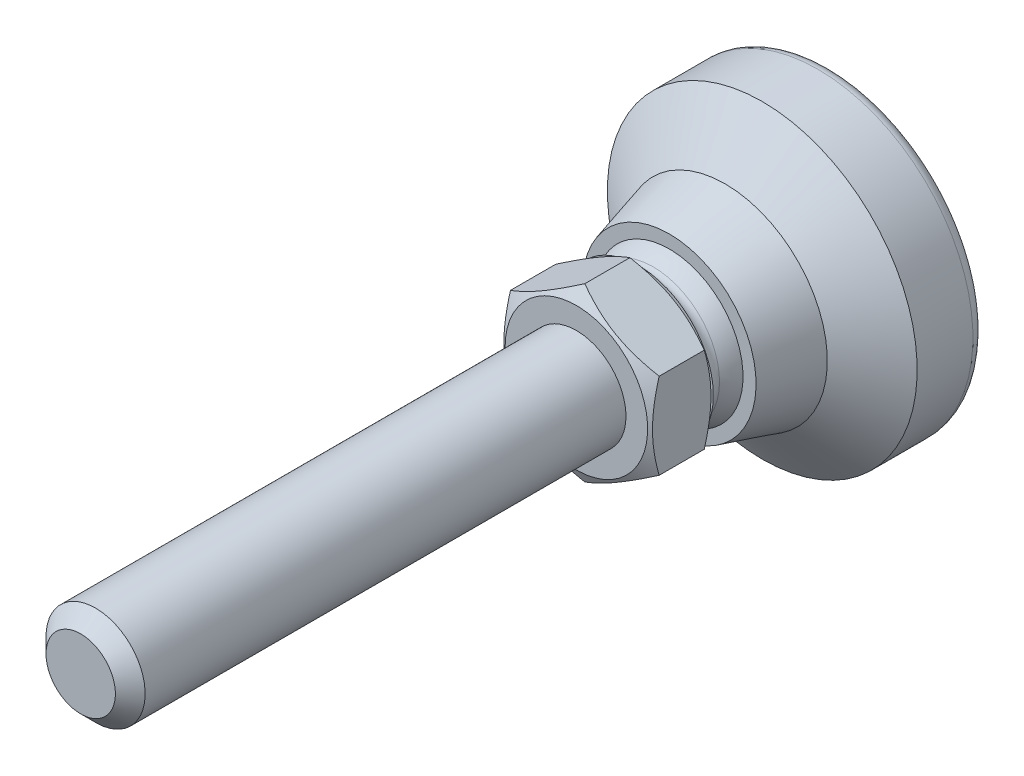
ISO-10303-21;
HEADER;
FILE_DESCRIPTION(('STEP AP214'),'2;1');
FILE_NAME('part.step','',(''),(''),'','','');
FILE_SCHEMA(('AUTOMOTIVE_DESIGN { 1 0 10303 214 1 1 1 1 }'));
ENDSEC;
DATA;
#1=APPLICATION_CONTEXT('core data for automotive mechanical design processes');
#2=APPLICATION_PROTOCOL_DEFINITION('international standard','automotive_design',2000,#1);
#3=PRODUCT_CONTEXT('',#1,'mechanical');
#4=PRODUCT('Part','Part','',(#3));
#5=PRODUCT_RELATED_PRODUCT_CATEGORY('part','',(#4));
#6=PRODUCT_DEFINITION_FORMATION('','',#4);
#7=PRODUCT_DEFINITION_CONTEXT('part definition',#1,'design');
#8=PRODUCT_DEFINITION('design','',#6,#7);
#9=PRODUCT_DEFINITION_SHAPE('','',#8);
#10=(LENGTH_UNIT() NAMED_UNIT(*) SI_UNIT(.MILLI.,.METRE.));
#11=(NAMED_UNIT(*) PLANE_ANGLE_UNIT() SI_UNIT($,.RADIAN.));
#12=(NAMED_UNIT(*) SI_UNIT($,.STERADIAN.) SOLID_ANGLE_UNIT());
#13=UNCERTAINTY_MEASURE_WITH_UNIT(LENGTH_MEASURE(1.E-05),#10,'distance_accuracy_value','');
#14=(GEOMETRIC_REPRESENTATION_CONTEXT(3) GLOBAL_UNCERTAINTY_ASSIGNED_CONTEXT((#13)) GLOBAL_UNIT_ASSIGNED_CONTEXT((#10,
#11,#12)) REPRESENTATION_CONTEXT('',''));
#15=CARTESIAN_POINT('',(0.,0.,0.));
#16=DIRECTION('',(0.,0.,1.));
#17=DIRECTION('',(1.,0.,0.));
#18=AXIS2_PLACEMENT_3D('',#15,#16,#17);
#19=CARTESIAN_POINT('',(0.,0.,14.6997728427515));
#20=DIRECTION('',(0.,0.,-1.));
#21=DIRECTION('',(0.,1.,0.));
#22=AXIS2_PLACEMENT_3D('',#19,#20,#21);
#23=TOROIDAL_SURFACE('',#22,6.05010572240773,0.800227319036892);
#24=CARTESIAN_POINT('',(0.,0.,14.3053528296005));
#25=DIRECTION('',(0.,0.,-1.));
#26=DIRECTION('',(0.,1.,0.));
#27=AXIS2_PLACEMENT_3D('',#24,#25,#26);
#28=CIRCLE('',#27,5.35383234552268);
#29=CARTESIAN_POINT('',(-5.3538323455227,0.,14.3053528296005));
#30=VERTEX_POINT('',#29);
#31=EDGE_CURVE('E163',#30,#30,#28,.T.);
#32=ORIENTED_EDGE('',*,*,#31,.F.);
#33=EDGE_LOOP('',(#32));
#34=FACE_BOUND('',#33,.T.);
#35=CARTESIAN_POINT('',(2.32740595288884,5.58441436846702,15.5000001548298));
#36=CARTESIAN_POINT('',(2.38730882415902,5.55944918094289,15.5000001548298));
#37=CARTESIAN_POINT('',(2.44680968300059,5.53351945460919,15.5000001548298));
#38=CARTESIAN_POINT('',(2.56494646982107,5.47975932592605,15.5000001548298));
#39=CARTESIAN_POINT('',(2.62358239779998,5.45192892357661,15.5000001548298));
#40=CARTESIAN_POINT('',(2.73992841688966,5.39439584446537,15.5000001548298));
#41=CARTESIAN_POINT('',(2.79763850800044,5.36469316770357,15.5000001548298));
#42=CARTESIAN_POINT('',(2.91207314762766,5.30344640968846,15.5000001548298));
#43=CARTESIAN_POINT('',(2.96879769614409,5.27190232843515,15.5000001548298));
#44=CARTESIAN_POINT('',(3.08120249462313,5.20700538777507,15.5000001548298));
#45=CARTESIAN_POINT('',(3.13688274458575,5.17365252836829,15.5000001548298));
#46=CARTESIAN_POINT('',(3.24714131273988,5.10517260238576,15.5000001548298));
#47=CARTESIAN_POINT('',(3.30171963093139,5.07004553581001,15.5000001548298));
#48=CARTESIAN_POINT('',(3.40971774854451,4.99805346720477,15.5000001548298));
#49=CARTESIAN_POINT('',(3.46313754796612,4.96118846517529,15.5000001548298));
#50=CARTESIAN_POINT('',(3.56876357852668,4.88575907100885,15.5000001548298));
#51=CARTESIAN_POINT('',(3.62096980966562,4.84719467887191,15.5000001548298));
#52=CARTESIAN_POINT('',(3.67254173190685,4.80779986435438,15.5000001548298));
#53=B_SPLINE_CURVE_WITH_KNOTS('',3,(#35,#36,#37,#38,#39,#40,#41,#42,#43,#44,#45,#46,#47,#48,#49,
#50,#51,#52),.UNSPECIFIED.,.F.,.F.,(4,2,2,2,2,2,2,2,4),(0.,0.194682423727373,0.389364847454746,
0.584047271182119,0.778729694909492,0.973412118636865,1.16809454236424,1.36277696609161,
1.55745938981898),.UNSPECIFIED.);
#54=CARTESIAN_POINT('',(2.32724464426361,5.58455280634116,15.5000001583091));
#55=VERTEX_POINT('',#54);
#56=CARTESIAN_POINT('',(3.67274227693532,4.80772938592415,15.5000001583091));
#57=VERTEX_POINT('',#56);
#58=EDGE_CURVE('E109',#55,#57,#53,.T.);
#59=ORIENTED_EDGE('',*,*,#58,.T.);
#60=CARTESIAN_POINT('',(0.,0.,15.5000001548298));
#61=DIRECTION('',(0.,0.,-1.));
#62=DIRECTION('',(0.,1.,0.));
#63=AXIS2_PLACEMENT_3D('',#60,#61,#62);
#64=CIRCLE('',#63,6.05000019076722);
#65=CARTESIAN_POINT('',(5.99998692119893,0.77682342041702,15.5000001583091));
#66=VERTEX_POINT('',#65);
#67=EDGE_CURVE('E169',#57,#66,#64,.T.);
#68=ORIENTED_EDGE('',*,*,#67,.T.);
#69=CARTESIAN_POINT('',(5.9999476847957,0.776614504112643,15.5000001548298));
#70=CARTESIAN_POINT('',(6.00827863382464,0.712254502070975,15.5000001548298));
#71=CARTESIAN_POINT('',(6.01557326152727,0.647760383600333,15.5000001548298));
#72=CARTESIAN_POINT('',(6.02808401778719,0.518570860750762,15.5000001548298));
#73=CARTESIAN_POINT('',(6.03330014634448,0.453875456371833,15.5000001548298));
#74=CARTESIAN_POINT('',(6.04164804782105,0.324350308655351,15.5000001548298));
#75=CARTESIAN_POINT('',(6.04477982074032,0.259520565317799,15.5000001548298));
#76=CARTESIAN_POINT('',(6.04895589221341,0.129793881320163,15.5000001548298));
#77=CARTESIAN_POINT('',(6.05000019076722,0.064896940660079,15.5000001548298));
#78=CARTESIAN_POINT('',(6.05000019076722,-0.0648969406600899,15.5000001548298));
#79=CARTESIAN_POINT('',(6.04895589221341,-0.129793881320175,15.5000001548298));
#80=CARTESIAN_POINT('',(6.04477982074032,-0.259520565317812,15.5000001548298));
#81=CARTESIAN_POINT('',(6.04164804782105,-0.324350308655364,15.5000001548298));
#82=CARTESIAN_POINT('',(6.03330014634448,-0.453875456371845,15.5000001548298));
#83=CARTESIAN_POINT('',(6.02808401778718,-0.518570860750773,15.5000001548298));
#84=CARTESIAN_POINT('',(6.01557326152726,-0.647760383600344,15.5000001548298));
#85=CARTESIAN_POINT('',(6.00827863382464,-0.712254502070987,15.5000001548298));
#86=CARTESIAN_POINT('',(5.9999476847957,-0.776614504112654,15.5000001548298));
#87=B_SPLINE_CURVE_WITH_KNOTS('',3,(#69,#70,#71,#72,#73,#74,#75,#76,#77,#78,#79,#80,#81,#82,#83,
#84,#85,#86),.UNSPECIFIED.,.F.,.F.,(4,2,2,2,2,2,2,2,4),(0.,0.194682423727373,0.389364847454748,
0.584047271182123,0.778729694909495,0.973412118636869,1.16809454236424,1.36277696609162,
1.55745938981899),.UNSPECIFIED.);
#88=CARTESIAN_POINT('',(5.99998692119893,-0.77682342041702,15.5000001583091));
#89=VERTEX_POINT('',#88);
#90=EDGE_CURVE('E615',#66,#89,#87,.T.);
#91=ORIENTED_EDGE('',*,*,#90,.T.);
#92=CARTESIAN_POINT('',(3.67274227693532,-4.80772938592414,15.5000001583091));
#93=VERTEX_POINT('',#92);
#94=EDGE_CURVE('E179',#89,#93,#64,.T.);
#95=ORIENTED_EDGE('',*,*,#94,.T.);
#96=CARTESIAN_POINT('',(3.67254173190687,-4.80779986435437,15.5000001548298));
#97=CARTESIAN_POINT('',(3.62096980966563,-4.8471946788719,15.5000001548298));
#98=CARTESIAN_POINT('',(3.56876357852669,-4.88575907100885,15.5000001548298));
#99=CARTESIAN_POINT('',(3.46313754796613,-4.96118846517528,15.5000001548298));
#100=CARTESIAN_POINT('',(3.40971774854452,-4.99805346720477,15.5000001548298));
#101=CARTESIAN_POINT('',(3.3017196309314,-5.07004553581,15.5000001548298));
#102=CARTESIAN_POINT('',(3.24714131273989,-5.10517260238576,15.5000001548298));
#103=CARTESIAN_POINT('',(3.13688274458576,-5.17365252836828,15.5000001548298));
#104=CARTESIAN_POINT('',(3.08120249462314,-5.20700538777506,15.5000001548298));
#105=CARTESIAN_POINT('',(2.9687976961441,-5.27190232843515,15.5000001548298));
#106=CARTESIAN_POINT('',(2.91207314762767,-5.30344640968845,15.5000001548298));
#107=CARTESIAN_POINT('',(2.79763850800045,-5.36469316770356,15.5000001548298));
#108=CARTESIAN_POINT('',(2.73992841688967,-5.39439584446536,15.5000001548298));
#109=CARTESIAN_POINT('',(2.62358239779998,-5.4519289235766,15.5000001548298));
#110=CARTESIAN_POINT('',(2.56494646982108,-5.47975932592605,15.5000001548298));
#111=CARTESIAN_POINT('',(2.4468096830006,-5.53351945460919,15.5000001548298));
#112=CARTESIAN_POINT('',(2.38730882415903,-5.55944918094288,15.5000001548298));
#113=CARTESIAN_POINT('',(2.32740595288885,-5.58441436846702,15.5000001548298));
#114=B_SPLINE_CURVE_WITH_KNOTS('',3,(#96,#97,#98,#99,#100,#101,#102,#103,#104,#105,#106,#107,
#108,#109,#110,#111,#112,#113),.UNSPECIFIED.,.F.,.F.,(4,2,2,2,2,2,2,2,4),(0.,0.194682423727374,
0.389364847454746,0.584047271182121,0.778729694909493,0.973412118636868,1.16809454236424,
1.36277696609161,1.55745938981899),.UNSPECIFIED.);
#115=CARTESIAN_POINT('',(2.32724464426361,-5.58455280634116,15.5000001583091));
#116=VERTEX_POINT('',#115);
#117=EDGE_CURVE('E262',#93,#116,#114,.T.);
#118=ORIENTED_EDGE('',*,*,#117,.T.);
#119=CARTESIAN_POINT('',(-2.32724464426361,-5.58455280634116,15.5000001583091));
#120=VERTEX_POINT('',#119);
#121=EDGE_CURVE('E181',#116,#120,#64,.T.);
#122=ORIENTED_EDGE('',*,*,#121,.T.);
#123=CARTESIAN_POINT('',(-2.32740595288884,-5.58441436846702,15.5000001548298));
#124=CARTESIAN_POINT('',(-2.38730882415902,-5.55944918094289,15.5000001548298));
#125=CARTESIAN_POINT('',(-2.44680968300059,-5.53351945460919,15.5000001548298));
#126=CARTESIAN_POINT('',(-2.56494646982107,-5.47975932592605,15.5000001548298));
#127=CARTESIAN_POINT('',(-2.62358239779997,-5.45192892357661,15.5000001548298));
#128=CARTESIAN_POINT('',(-2.73992841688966,-5.39439584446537,15.5000001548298));
#129=CARTESIAN_POINT('',(-2.79763850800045,-5.36469316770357,15.5000001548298));
#130=CARTESIAN_POINT('',(-2.91207314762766,-5.30344640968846,15.5000001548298));
#131=CARTESIAN_POINT('',(-2.96879769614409,-5.27190232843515,15.5000001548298));
#132=CARTESIAN_POINT('',(-3.08120249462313,-5.20700538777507,15.5000001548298));
#133=CARTESIAN_POINT('',(-3.13688274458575,-5.17365252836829,15.5000001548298));
#134=CARTESIAN_POINT('',(-3.24714131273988,-5.10517260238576,15.5000001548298));
#135=CARTESIAN_POINT('',(-3.30171963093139,-5.07004553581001,15.5000001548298));
#136=CARTESIAN_POINT('',(-3.40971774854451,-4.99805346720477,15.5000001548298));
#137=CARTESIAN_POINT('',(-3.46313754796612,-4.96118846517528,15.5000001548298));
#138=CARTESIAN_POINT('',(-3.56876357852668,-4.88575907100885,15.5000001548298));
#139=CARTESIAN_POINT('',(-3.62096980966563,-4.84719467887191,15.5000001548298));
#140=CARTESIAN_POINT('',(-3.67254173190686,-4.80779986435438,15.5000001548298));
#141=B_SPLINE_CURVE_WITH_KNOTS('',3,(#123,#124,#125,#126,#127,#128,#129,#130,#131,#132,#133,
#134,#135,#136,#137,#138,#139,#140),.UNSPECIFIED.,.F.,.F.,(4,2,2,2,2,2,2,2,4),(0.,
0.194682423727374,0.389364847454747,0.584047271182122,0.778729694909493,0.973412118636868,
1.16809454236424,1.36277696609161,1.55745938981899),.UNSPECIFIED.);
#142=CARTESIAN_POINT('',(-3.67274227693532,-4.80772938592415,15.5000001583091));
#143=VERTEX_POINT('',#142);
#144=EDGE_CURVE('E148',#120,#143,#141,.T.);
#145=ORIENTED_EDGE('',*,*,#144,.T.);
#146=CARTESIAN_POINT('',(-5.99999019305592,-0.776824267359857,15.5000001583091));
#147=VERTEX_POINT('',#146);
#148=EDGE_CURVE('E183',#143,#147,#64,.T.);
#149=ORIENTED_EDGE('',*,*,#148,.T.);
#150=CARTESIAN_POINT('',(-5.9999476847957,-0.776614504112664,15.5000001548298));
#151=CARTESIAN_POINT('',(-6.00827863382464,-0.712254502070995,15.5000001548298));
#152=CARTESIAN_POINT('',(-6.01557326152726,-0.647760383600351,15.5000001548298));
#153=CARTESIAN_POINT('',(-6.02808401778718,-0.518570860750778,15.5000001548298));
#154=CARTESIAN_POINT('',(-6.03330014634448,-0.453875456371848,15.5000001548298));
#155=CARTESIAN_POINT('',(-6.04164804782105,-0.324350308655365,15.5000001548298));
#156=CARTESIAN_POINT('',(-6.04477982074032,-0.259520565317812,15.5000001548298));
#157=CARTESIAN_POINT('',(-6.04895589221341,-0.129793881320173,15.5000001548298));
#158=CARTESIAN_POINT('',(-6.05000019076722,-0.0648969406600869,15.5000001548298));
#159=CARTESIAN_POINT('',(-6.05000019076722,0.0648969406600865,15.5000001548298));
#160=CARTESIAN_POINT('',(-6.04895589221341,0.129793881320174,15.5000001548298));
#161=CARTESIAN_POINT('',(-6.04477982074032,0.259520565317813,15.5000001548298));
#162=CARTESIAN_POINT('',(-6.04164804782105,0.324350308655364,15.5000001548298));
#163=CARTESIAN_POINT('',(-6.03330014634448,0.453875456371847,15.5000001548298));
#164=CARTESIAN_POINT('',(-6.02808401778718,0.518570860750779,15.5000001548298));
#165=CARTESIAN_POINT('',(-6.01557326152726,0.647760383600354,15.5000001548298));
#166=CARTESIAN_POINT('',(-6.00827863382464,0.712254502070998,15.5000001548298));
#167=CARTESIAN_POINT('',(-5.99994768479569,0.776614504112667,15.5000001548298));
#168=B_SPLINE_CURVE_WITH_KNOTS('',3,(#150,#151,#152,#153,#154,#155,#156,#157,#158,#159,#160,
#161,#162,#163,#164,#165,#166,#167),.UNSPECIFIED.,.F.,.F.,(4,2,2,2,2,2,2,2,4),(0.,
0.194682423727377,0.389364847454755,0.584047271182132,0.778729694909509,0.973412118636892,
1.16809454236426,1.36277696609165,1.55745938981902),.UNSPECIFIED.);
#169=CARTESIAN_POINT('',(-5.99998692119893,0.776823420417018,15.5000001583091));
#170=VERTEX_POINT('',#169);
#171=EDGE_CURVE('E121',#147,#170,#168,.T.);
#172=ORIENTED_EDGE('',*,*,#171,.T.);
#173=CARTESIAN_POINT('',(-3.67274464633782,4.80773179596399,15.5000001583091));
#174=VERTEX_POINT('',#173);
#175=EDGE_CURVE('E185',#170,#174,#64,.T.);
#176=ORIENTED_EDGE('',*,*,#175,.T.);
#177=CARTESIAN_POINT('',(-3.67254173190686,4.80779986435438,15.5000001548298));
#178=CARTESIAN_POINT('',(-3.62096980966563,4.84719467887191,15.5000001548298));
#179=CARTESIAN_POINT('',(-3.56876357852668,4.88575907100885,15.5000001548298));
#180=CARTESIAN_POINT('',(-3.46313754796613,4.96118846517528,15.5000001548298));
#181=CARTESIAN_POINT('',(-3.40971774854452,4.99805346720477,15.5000001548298));
#182=CARTESIAN_POINT('',(-3.3017196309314,5.07004553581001,15.5000001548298));
#183=CARTESIAN_POINT('',(-3.24714131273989,5.10517260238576,15.5000001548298));
#184=CARTESIAN_POINT('',(-3.13688274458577,5.17365252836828,15.5000001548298));
#185=CARTESIAN_POINT('',(-3.08120249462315,5.20700538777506,15.5000001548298));
#186=CARTESIAN_POINT('',(-2.9687976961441,5.27190232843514,15.5000001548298));
#187=CARTESIAN_POINT('',(-2.91207314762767,5.30344640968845,15.5000001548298));
#188=CARTESIAN_POINT('',(-2.79763850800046,5.36469316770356,15.5000001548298));
#189=CARTESIAN_POINT('',(-2.73992841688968,5.39439584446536,15.5000001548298));
#190=CARTESIAN_POINT('',(-2.62358239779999,5.4519289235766,15.5000001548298));
#191=CARTESIAN_POINT('',(-2.56494646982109,5.47975932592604,15.5000001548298));
#192=CARTESIAN_POINT('',(-2.44680968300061,5.53351945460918,15.5000001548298));
#193=CARTESIAN_POINT('',(-2.38730882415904,5.55944918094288,15.5000001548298));
#194=CARTESIAN_POINT('',(-2.32740595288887,5.58441436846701,15.5000001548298));
#195=B_SPLINE_CURVE_WITH_KNOTS('',3,(#177,#178,#179,#180,#181,#182,#183,#184,#185,#186,#187,
#188,#189,#190,#191,#192,#193,#194),.UNSPECIFIED.,.F.,.F.,(4,2,2,2,2,2,2,2,4),(0.,
0.194682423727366,0.389364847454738,0.58404727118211,0.778729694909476,0.973412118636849,
1.16809454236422,1.36277696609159,1.55745938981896),.UNSPECIFIED.);
#196=CARTESIAN_POINT('',(-2.32724464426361,5.58455280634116,15.5000001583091));
#197=VERTEX_POINT('',#196);
#198=EDGE_CURVE('E124',#174,#197,#195,.T.);
#199=ORIENTED_EDGE('',*,*,#198,.T.);
#200=EDGE_CURVE('E166',#197,#55,#64,.T.);
#201=ORIENTED_EDGE('',*,*,#200,.T.);
#202=EDGE_LOOP('',(#59,#68,#91,#95,#118,#122,#145,#149,#172,#176,#199,#201));
#203=FACE_BOUND('',#202,.T.);
#204=ADVANCED_FACE('F14',(#34,#203),#23,.F.);
#205=CARTESIAN_POINT('',(0.,0.,11.080608));
#206=DIRECTION('',(0.,0.,-1.));
#207=DIRECTION('',(-1.,0.,0.));
#208=AXIS2_PLACEMENT_3D('',#205,#206,#207);
#209=SPHERICAL_SURFACE('',#208,6.25);
#210=CARTESIAN_POINT('',(0.,0.,13.0000001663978));
#211=DIRECTION('',(0.,0.,-1.));
#212=DIRECTION('',(0.,1.,0.));
#213=AXIS2_PLACEMENT_3D('',#210,#211,#212);
#214=CIRCLE('',#213,5.94797727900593);
#215=CARTESIAN_POINT('',(-5.94797727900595,0.,13.0000001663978));
#216=VERTEX_POINT('',#215);
#217=EDGE_CURVE('E160',#216,#216,#214,.T.);
#218=CARTESIAN_POINT('',(-5.94797727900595,0.,13.0000001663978));
#219=CARTESIAN_POINT('',(-5.94337913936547,0.,13.0142492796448));
#220=CARTESIAN_POINT('',(-5.9387297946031,0.,13.028481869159));
#221=CARTESIAN_POINT('',(-5.92932893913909,0.,13.0569132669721));
#222=CARTESIAN_POINT('',(-5.92457742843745,0.,13.0711120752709));
#223=CARTESIAN_POINT('',(-5.91497248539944,0.,13.0994751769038));
#224=CARTESIAN_POINT('',(-5.91011905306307,0.,13.1136394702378));
#225=CARTESIAN_POINT('',(-5.90031051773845,0.,13.1419328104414));
#226=CARTESIAN_POINT('',(-5.8953554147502,0.,13.1560618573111));
#227=CARTESIAN_POINT('',(-5.88534379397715,0.,13.1842839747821));
#228=CARTESIAN_POINT('',(-5.88028727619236,0.,13.1983770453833));
#229=CARTESIAN_POINT('',(-5.87007308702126,0.,13.2265264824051));
#230=CARTESIAN_POINT('',(-5.86491541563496,0.,13.2405828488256));
#231=CARTESIAN_POINT('',(-5.85449918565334,0.,13.2686581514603));
#232=CARTESIAN_POINT('',(-5.84924062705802,0.,13.2826770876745));
#233=CARTESIAN_POINT('',(-5.83862289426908,0.,13.3106768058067));
#234=CARTESIAN_POINT('',(-5.83326372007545,0.,13.3246575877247));
#235=CARTESIAN_POINT('',(-5.82244503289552,0.,13.3525802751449));
#236=CARTESIAN_POINT('',(-5.81698551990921,0.,13.366522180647));
#237=CARTESIAN_POINT('',(-5.80596643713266,0.,13.3943663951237));
#238=CARTESIAN_POINT('',(-5.80040686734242,0.,13.4082687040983));
#239=CARTESIAN_POINT('',(-5.78918795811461,0.,13.4360330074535));
#240=CARTESIAN_POINT('',(-5.78352861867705,0.,13.4498950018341));
#241=CARTESIAN_POINT('',(-5.77211046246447,0.,13.4775779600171));
#242=CARTESIAN_POINT('',(-5.76635164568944,0.,13.4913989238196));
#243=CARTESIAN_POINT('',(-5.75473483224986,0.,13.5189991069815));
#244=CARTESIAN_POINT('',(-5.7488768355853,0.,13.532778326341));
#245=CARTESIAN_POINT('',(-5.73706196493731,0.,13.560294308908));
#246=CARTESIAN_POINT('',(-5.73110509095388,0.,13.5740310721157));
#247=CARTESIAN_POINT('',(-5.71909277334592,0.,13.6014614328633));
#248=CARTESIAN_POINT('',(-5.71303732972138,0.,13.6151550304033));
#249=CARTESIAN_POINT('',(-5.70082818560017,0.,13.6424983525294));
#250=CARTESIAN_POINT('',(-5.69467448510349,0.,13.6561480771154));
#251=CARTESIAN_POINT('',(-5.68226914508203,0.,13.6834029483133));
#252=CARTESIAN_POINT('',(-5.67601750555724,0.,13.6970080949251));
#253=CARTESIAN_POINT('',(-5.66341661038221,0.,13.7241731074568));
#254=CARTESIAN_POINT('',(-5.65706735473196,0.,13.7377329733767));
#255=CARTESIAN_POINT('',(-5.64427155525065,0.,13.7648067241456));
#256=CARTESIAN_POINT('',(-5.63782501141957,0.,13.7783206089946));
#257=CARTESIAN_POINT('',(-5.62483496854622,0.,13.8053016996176));
#258=CARTESIAN_POINT('',(-5.61829146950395,0.,13.8187689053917));
#259=CARTESIAN_POINT('',(-5.60510785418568,0.,13.845655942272));
#260=CARTESIAN_POINT('',(-5.59846773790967,0.,13.8590757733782));
#261=CARTESIAN_POINT('',(-5.58509123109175,0.,13.8858673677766));
#262=CARTESIAN_POINT('',(-5.57835484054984,0.,13.8992391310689));
#263=CARTESIAN_POINT('',(-5.56478613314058,0.,13.9259338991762));
#264=CARTESIAN_POINT('',(-5.55795381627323,0.,13.9392569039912));
#265=CARTESIAN_POINT('',(-5.54419360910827,0.,13.9658534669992));
#266=CARTESIAN_POINT('',(-5.53726571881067,0.,13.9791270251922));
#267=CARTESIAN_POINT('',(-5.5233147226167,0.,14.005624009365));
#268=CARTESIAN_POINT('',(-5.51629161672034,0.,14.0188474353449));
#269=CARTESIAN_POINT('',(-5.50215055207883,0.,14.0452434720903));
#270=CARTESIAN_POINT('',(-5.49503259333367,0.,14.0584160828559));
#271=CARTESIAN_POINT('',(-5.48070219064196,0.,14.0847098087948));
#272=CARTESIAN_POINT('',(-5.4734897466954,0.,14.0978309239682));
#273=CARTESIAN_POINT('',(-5.45897074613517,0.,14.124020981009));
#274=CARTESIAN_POINT('',(-5.45166418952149,0.,14.1370899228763));
#275=CARTESIAN_POINT('',(-5.43695734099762,0.,14.163174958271));
#276=CARTESIAN_POINT('',(-5.42955704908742,0.,14.1761910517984));
#277=CARTESIAN_POINT('',(-5.41466311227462,0.,14.2021697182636));
#278=CARTESIAN_POINT('',(-5.40716946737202,0.,14.2151322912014));
#279=CARTESIAN_POINT('',(-5.39208921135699,0.,14.2410032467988));
#280=CARTESIAN_POINT('',(-5.38450260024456,0.,14.2539116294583));
#281=CARTESIAN_POINT('',(-5.36923680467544,0.,14.2796735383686));
#282=CARTESIAN_POINT('',(-5.36155762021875,0.,14.2925270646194));
#283=CARTESIAN_POINT('',(-5.3538323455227,0.,14.3053528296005));
#284=B_SPLINE_CURVE_WITH_KNOTS('',3,(#218,#219,#220,#221,#222,#223,#224,#225,#226,#227,#228,
#229,#230,#231,#232,#233,#234,#235,#236,#237,#238,#239,#240,#241,#242,#243,#244,#245,#246,#247,
#248,#249,#250,#251,#252,#253,#254,#255,#256,#257,#258,#259,#260,#261,#262,#263,#264,#265,#266,
#267,#268,#269,#270,#271,#272,#273,#274,#275,#276,#277,#278,#279,#280,#281,#282,#283),
.UNSPECIFIED.,.F.,.F.,(4,2,2,2,2,2,2,2,2,2,2,2,2,2,2,2,2,2,2,2,2,2,2,2,2,2,2,2,2,2,2,2,4),(0.,
0.0449178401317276,0.0898356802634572,0.134753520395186,0.179671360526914,0.224589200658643,
0.269507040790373,0.314424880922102,0.359342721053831,0.40426056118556,0.449178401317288,
0.494096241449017,0.539014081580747,0.583931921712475,0.628849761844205,0.673767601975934,
0.718685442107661,0.76360328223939,0.80852112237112,0.853438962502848,0.898356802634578,
0.943274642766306,0.988192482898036,1.03311032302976,1.07802816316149,1.12294600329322,
1.16786384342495,1.21278168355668,1.25769952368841,1.30261736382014,1.34753520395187,
1.3924530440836,1.43737088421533),.UNSPECIFIED.);
#285=EDGE_CURVE('BSEAM280',#216,#30,#284,.T.);
#286=ORIENTED_EDGE('',*,*,#217,.F.);
#287=ORIENTED_EDGE('',*,*,#31,.T.);
#288=ORIENTED_EDGE('',*,*,#285,.T.);
#289=ORIENTED_EDGE('',*,*,#285,.F.);
#290=EDGE_LOOP('',(#286,#288,#287,#289));
#291=FACE_BOUND('',#290,.T.);
#292=ADVANCED_FACE('F280',(#291),#209,.T.);
#293=CARTESIAN_POINT('',(-6.35,0.,13.));
#294=DIRECTION('',(0.,0.,-1.));
#295=DIRECTION('',(0.,1.,0.));
#296=AXIS2_PLACEMENT_3D('',#293,#294,#295);
#297=PLANE('',#296);
#298=CARTESIAN_POINT('',(0.,0.,13.));
#299=DIRECTION('',(0.,0.,-1.));
#300=DIRECTION('',(0.,1.,0.));
#301=AXIS2_PLACEMENT_3D('',#298,#299,#300);
#302=CIRCLE('',#301,7.);
#303=CARTESIAN_POINT('',(0.,7.,13.));
#304=VERTEX_POINT('',#303);
#305=EDGE_CURVE('E157',#304,#304,#302,.T.);
#306=ORIENTED_EDGE('',*,*,#305,.F.);
#307=EDGE_LOOP('',(#306));
#308=FACE_BOUND('',#307,.T.);
#309=ORIENTED_EDGE('',*,*,#217,.T.);
#310=EDGE_LOOP('',(#309));
#311=FACE_BOUND('',#310,.T.);
#312=ADVANCED_FACE('F565',(#308,#311),#297,.F.);
#313=CARTESIAN_POINT('',(0.,0.,13.));
#314=DIRECTION('',(0.,0.,-1.));
#315=DIRECTION('',(0.,1.,0.));
#316=AXIS2_PLACEMENT_3D('',#313,#314,#315);
#317=CONICAL_SURFACE('',#316,7.,0.270946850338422);
#318=CARTESIAN_POINT('',(0.,0.,8.5));
#319=DIRECTION('',(0.,0.,-1.));
#320=DIRECTION('',(0.,1.,0.));
#321=AXIS2_PLACEMENT_3D('',#318,#319,#320);
#322=CIRCLE('',#321,8.25);
#323=CARTESIAN_POINT('',(0.,8.25,8.5));
#324=VERTEX_POINT('',#323);
#325=EDGE_CURVE('E154',#324,#324,#322,.T.);
#326=ORIENTED_EDGE('',*,*,#325,.F.);
#327=EDGE_LOOP('',(#326));
#328=FACE_BOUND('',#327,.T.);
#329=ORIENTED_EDGE('',*,*,#305,.T.);
#330=EDGE_LOOP('',(#329));
#331=FACE_BOUND('',#330,.T.);
#332=ADVANCED_FACE('F555',(#328,#331),#317,.T.);
#333=CARTESIAN_POINT('',(0.,0.,8.5));
#334=DIRECTION('',(0.,0.,-1.));
#335=DIRECTION('',(0.,1.,0.));
#336=AXIS2_PLACEMENT_3D('',#333,#334,#335);
#337=CONICAL_SURFACE('',#336,8.25,0.956133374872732);
#338=CARTESIAN_POINT('',(0.,0.,5.5));
#339=DIRECTION('',(0.,0.,-1.));
#340=DIRECTION('',(0.,1.,0.));
#341=AXIS2_PLACEMENT_3D('',#338,#339,#340);
#342=CIRCLE('',#341,12.5);
#343=CARTESIAN_POINT('',(0.,12.5,5.5));
#344=VERTEX_POINT('',#343);
#345=EDGE_CURVE('E151',#344,#344,#342,.T.);
#346=ORIENTED_EDGE('',*,*,#345,.F.);
#347=EDGE_LOOP('',(#346));
#348=FACE_BOUND('',#347,.T.);
#349=ORIENTED_EDGE('',*,*,#325,.T.);
#350=EDGE_LOOP('',(#349));
#351=FACE_BOUND('',#350,.T.);
#352=ADVANCED_FACE('F545',(#348,#351),#337,.T.);
#353=CARTESIAN_POINT('',(0.,0.,0.));
#354=DIRECTION('',(0.,0.,-1.));
#355=DIRECTION('',(0.,1.,0.));
#356=AXIS2_PLACEMENT_3D('',#353,#354,#355);
#357=CYLINDRICAL_SURFACE('',#356,12.5);
#358=CARTESIAN_POINT('',(0.,0.,1.));
#359=DIRECTION('',(0.,0.,-1.));
#360=DIRECTION('',(0.,1.,0.));
#361=AXIS2_PLACEMENT_3D('',#358,#359,#360);
#362=CIRCLE('',#361,12.5);
#363=CARTESIAN_POINT('',(0.,12.5,1.));
#364=VERTEX_POINT('',#363);
#365=EDGE_CURVE('E147',#364,#364,#362,.T.);
#366=ORIENTED_EDGE('',*,*,#365,.F.);
#367=EDGE_LOOP('',(#366));
#368=FACE_BOUND('',#367,.T.);
#369=ORIENTED_EDGE('',*,*,#345,.T.);
#370=EDGE_LOOP('',(#369));
#371=FACE_BOUND('',#370,.T.);
#372=ADVANCED_FACE('F536',(#368,#371),#357,.T.);
#373=CARTESIAN_POINT('',(0.,0.,1.));
#374=DIRECTION('',(0.,0.,-1.));
#375=DIRECTION('',(0.,1.,0.));
#376=AXIS2_PLACEMENT_3D('',#373,#374,#375);
#377=TOROIDAL_SURFACE('',#376,11.5,1.);
#378=CARTESIAN_POINT('',(0.,0.,0.));
#379=DIRECTION('',(0.,0.,-1.));
#380=DIRECTION('',(0.,1.,0.));
#381=AXIS2_PLACEMENT_3D('',#378,#379,#380);
#382=CIRCLE('',#381,11.5);
#383=CARTESIAN_POINT('',(0.,11.5,0.));
#384=VERTEX_POINT('',#383);
#385=EDGE_CURVE('E144',#384,#384,#382,.T.);
#386=ORIENTED_EDGE('',*,*,#385,.F.);
#387=EDGE_LOOP('',(#386));
#388=FACE_BOUND('',#387,.T.);
#389=ORIENTED_EDGE('',*,*,#365,.T.);
#390=EDGE_LOOP('',(#389));
#391=FACE_BOUND('',#390,.T.);
#392=ADVANCED_FACE('F527',(#388,#391),#377,.T.);
#393=CARTESIAN_POINT('',(-11.5,0.,0.));
#394=DIRECTION('',(0.,0.,1.));
#395=DIRECTION('',(0.,-1.,0.));
#396=AXIS2_PLACEMENT_3D('',#393,#394,#395);
#397=PLANE('',#396);
#398=ORIENTED_EDGE('',*,*,#385,.T.);
#399=EDGE_LOOP('',(#398));
#400=FACE_BOUND('',#399,.T.);
#401=ADVANCED_FACE('F218',(#400),#397,.F.);
#402=CARTESIAN_POINT('',(0.,5.75,15.5000001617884));
#403=DIRECTION('',(0.,0.,-1.));
#404=DIRECTION('',(-1.,0.,0.));
#405=AXIS2_PLACEMENT_3D('',#402,#403,#404);
#406=PLANE('',#405);
#407=ORIENTED_EDGE('',*,*,#144,.F.);
#408=ORIENTED_EDGE('',*,*,#121,.F.);
#409=ORIENTED_EDGE('',*,*,#117,.F.);
#410=ORIENTED_EDGE('',*,*,#94,.F.);
#411=ORIENTED_EDGE('',*,*,#90,.F.);
#412=ORIENTED_EDGE('',*,*,#67,.F.);
#413=ORIENTED_EDGE('',*,*,#58,.F.);
#414=ORIENTED_EDGE('',*,*,#200,.F.);
#415=ORIENTED_EDGE('',*,*,#198,.F.);
#416=ORIENTED_EDGE('',*,*,#175,.F.);
#417=ORIENTED_EDGE('',*,*,#171,.F.);
#418=ORIENTED_EDGE('',*,*,#148,.F.);
#419=EDGE_LOOP('',(#407,#408,#409,#410,#411,#412,#413,#414,#415,#416,#417,#418));
#420=FACE_BOUND('',#419,.T.);
#421=CARTESIAN_POINT('',(0.,0.,15.5000001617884));
#422=DIRECTION('',(0.,0.,-1.));
#423=DIRECTION('',(-1.,0.,0.));
#424=AXIS2_PLACEMENT_3D('',#421,#422,#423);
#425=CIRCLE('',#424,5.75);
#426=CARTESIAN_POINT('',(-5.75,0.,15.5000001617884));
#427=VERTEX_POINT('',#426);
#428=EDGE_CURVE('E115',#427,#427,#425,.T.);
#429=ORIENTED_EDGE('',*,*,#428,.T.);
#430=EDGE_LOOP('',(#429));
#431=FACE_BOUND('',#430,.T.);
#432=ADVANCED_FACE('F194',(#420,#431),#406,.F.);
#433=CARTESIAN_POINT('',(0.,0.,16.9215140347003));
#434=DIRECTION('',(0.,0.,1.));
#435=DIRECTION('',(1.,0.,0.));
#436=AXIS2_PLACEMENT_3D('',#433,#434,#435);
#437=CONICAL_SURFACE('',#436,8.21213425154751,1.0471975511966);
#438=CARTESIAN_POINT('',(-6.0002,3.46398614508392,16.1803027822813));
#439=CARTESIAN_POINT('',(-5.86831298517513,3.54013114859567,16.1363467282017));
#440=CARTESIAN_POINT('',(-5.73593423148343,3.61656005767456,16.0943855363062));
#441=CARTESIAN_POINT('',(-5.47010166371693,3.77003856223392,16.0150023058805));
#442=CARTESIAN_POINT('',(-5.33664741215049,3.8470884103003,15.9775822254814));
#443=CARTESIAN_POINT('',(-4.93414786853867,4.07947163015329,15.8728681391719));
#444=CARTESIAN_POINT('',(-4.66351376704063,4.23572230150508,15.8133077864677));
#445=CARTESIAN_POINT('',(-4.25851475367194,4.46954859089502,15.743465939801));
#446=CARTESIAN_POINT('',(-4.12535995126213,4.54642555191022,15.7235699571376));
#447=CARTESIAN_POINT('',(-3.85844867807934,4.70052684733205,15.6902071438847));
#448=CARTESIAN_POINT('',(-3.72469226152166,4.77775115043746,15.6767397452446));
#449=CARTESIAN_POINT('',(-3.45694711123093,4.93233388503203,15.6565773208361));
#450=CARTESIAN_POINT('',(-3.32295881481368,5.00969206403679,15.6498746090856));
#451=CARTESIAN_POINT('',(-3.05486583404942,5.16447561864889,15.6433780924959));
#452=CARTESIAN_POINT('',(-2.92076115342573,5.24190099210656,15.6435840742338));
#453=CARTESIAN_POINT('',(-2.55335498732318,5.45402304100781,15.6536449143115));
#454=CARTESIAN_POINT('',(-2.3201737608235,5.58865028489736,15.670535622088));
#455=CARTESIAN_POINT('',(-1.85536008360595,5.85701058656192,15.7240969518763));
#456=CARTESIAN_POINT('',(-1.6237292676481,5.99074270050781,15.7607858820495));
#457=CARTESIAN_POINT('',(-1.15798010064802,6.25964310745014,15.8524978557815));
#458=CARTESIAN_POINT('',(-0.923920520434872,6.39477746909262,15.9079094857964));
#459=CARTESIAN_POINT('',(-0.459291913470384,6.66303092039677,16.0336716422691));
#460=CARTESIAN_POINT('',(-0.228716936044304,6.7961534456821,16.1039926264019));
#461=CARTESIAN_POINT('',(0.000200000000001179,6.92831870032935,16.1803027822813));
#462=B_SPLINE_CURVE_WITH_KNOTS('',3,(#438,#439,#440,#441,#442,#443,#444,#445,#446,#447,#448,
#449,#450,#451,#452,#453,#454,#455,#456,#457,#458,#459,#460,#461),.UNSPECIFIED.,.F.,.F.,(4,2,2,
2,2,2,2,2,2,2,2,4),(0.,0.475482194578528,0.951168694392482,1.90451835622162,2.36951738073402,
2.83447530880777,3.29890435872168,3.76331906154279,4.57182194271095,5.38107376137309,
6.20827406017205,7.03385036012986),.UNSPECIFIED.);
#463=CARTESIAN_POINT('',(-6.,3.46410161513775,16.180236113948));
#464=VERTEX_POINT('',#463);
#465=CARTESIAN_POINT('',(0.,6.92820323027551,16.180236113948));
#466=VERTEX_POINT('',#465);
#467=EDGE_CURVE('E29',#464,#466,#462,.T.);
#468=ORIENTED_EDGE('',*,*,#467,.T.);
#469=CARTESIAN_POINT('',(-0.000199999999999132,6.92831870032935,16.1803027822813));
#470=CARTESIAN_POINT('',(0.131687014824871,6.85217369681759,16.1363467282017));
#471=CARTESIAN_POINT('',(0.264065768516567,6.7757447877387,16.0943855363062));
#472=CARTESIAN_POINT('',(0.529898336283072,6.62226628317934,16.0150023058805));
#473=CARTESIAN_POINT('',(0.663352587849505,6.54521643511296,15.9775822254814));
#474=CARTESIAN_POINT('',(1.06585213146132,6.31283321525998,15.8728681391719));
#475=CARTESIAN_POINT('',(1.33648623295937,6.15658254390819,15.8133077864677));
#476=CARTESIAN_POINT('',(1.74148524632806,5.92275625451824,15.743465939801));
#477=CARTESIAN_POINT('',(1.87464004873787,5.84587929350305,15.7235699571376));
#478=CARTESIAN_POINT('',(2.14155132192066,5.69177799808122,15.6902071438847));
#479=CARTESIAN_POINT('',(2.27530773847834,5.6145536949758,15.6767397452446));
#480=CARTESIAN_POINT('',(2.54305288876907,5.45997096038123,15.6565773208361));
#481=CARTESIAN_POINT('',(2.67704118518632,5.38261278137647,15.6498746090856));
#482=CARTESIAN_POINT('',(2.94513416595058,5.22782922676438,15.6433780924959));
#483=CARTESIAN_POINT('',(3.07923884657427,5.1504038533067,15.6435840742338));
#484=CARTESIAN_POINT('',(3.44664501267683,4.93828180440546,15.6536449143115));
#485=CARTESIAN_POINT('',(3.6798262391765,4.80365456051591,15.670535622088));
#486=CARTESIAN_POINT('',(4.14463991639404,4.53529425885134,15.7240969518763));
#487=CARTESIAN_POINT('',(4.3762707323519,4.40156214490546,15.7607858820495));
#488=CARTESIAN_POINT('',(4.84201989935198,4.13266173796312,15.8524978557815));
#489=CARTESIAN_POINT('',(5.07607947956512,3.99752737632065,15.9079094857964));
#490=CARTESIAN_POINT('',(5.54070808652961,3.7292739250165,16.0336716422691));
#491=CARTESIAN_POINT('',(5.77128306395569,3.59615139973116,16.1039926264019));
#492=CARTESIAN_POINT('',(6.0002,3.46398614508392,16.1803027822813));
#493=B_SPLINE_CURVE_WITH_KNOTS('',3,(#469,#470,#471,#472,#473,#474,#475,#476,#477,#478,#479,
#480,#481,#482,#483,#484,#485,#486,#487,#488,#489,#490,#491,#492),.UNSPECIFIED.,.F.,.F.,(4,2,2,
2,2,2,2,2,2,2,2,4),(0.,0.475482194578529,0.951168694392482,1.90451835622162,2.36951738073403,
2.83447530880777,3.29890435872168,3.76331906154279,4.57182194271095,5.38107376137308,
6.20827406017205,7.03385036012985),.UNSPECIFIED.);
#494=CARTESIAN_POINT('',(6.,3.46410161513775,16.180236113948));
#495=VERTEX_POINT('',#494);
#496=EDGE_CURVE('E102',#466,#495,#493,.T.);
#497=ORIENTED_EDGE('',*,*,#496,.T.);
#498=CARTESIAN_POINT('',(6.,3.46430161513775,16.1802938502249));
#499=CARTESIAN_POINT('',(6.,3.31201186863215,16.1363381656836));
#500=CARTESIAN_POINT('',(6.,3.15915431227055,16.0943773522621));
#501=CARTESIAN_POINT('',(6.,2.8521978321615,16.0149948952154));
#502=CARTESIAN_POINT('',(6.,2.6980984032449,15.9775752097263));
#503=CARTESIAN_POINT('',(6.,2.23333279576,15.8728623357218));
#504=CARTESIAN_POINT('',(6.,1.92083203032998,15.8133028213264));
#505=CARTESIAN_POINT('',(6.,1.45318032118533,15.7434622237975));
#506=CARTESIAN_POINT('',(6.,1.29942666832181,15.7235666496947));
#507=CARTESIAN_POINT('',(6.,0.991224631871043,15.6902046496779));
#508=CARTESIAN_POINT('',(6.,0.836776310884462,15.6767376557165));
#509=CARTESIAN_POINT('',(6.,0.527611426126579,15.6565760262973));
#510=CARTESIAN_POINT('',(6.,0.372895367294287,15.6498737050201));
#511=CARTESIAN_POINT('',(6.,0.0633288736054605,15.643377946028));
#512=CARTESIAN_POINT('',(6.,-0.091521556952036,15.6435842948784));
#513=CARTESIAN_POINT('',(6.,-0.515760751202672,15.6536459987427));
#514=CARTESIAN_POINT('',(6.,-0.78501064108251,15.6705368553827));
#515=CARTESIAN_POINT('',(6.,-1.3217220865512,15.7240977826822));
#516=CARTESIAN_POINT('',(6.,-1.58918175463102,15.7607861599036));
#517=CARTESIAN_POINT('',(6.,-2.12697331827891,15.8524964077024));
#518=CARTESIAN_POINT('',(6.,-2.39723735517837,15.9079068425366));
#519=CARTESIAN_POINT('',(6.,-2.93373504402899,16.0336661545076));
#520=CARTESIAN_POINT('',(6.,-3.19997556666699,16.1039854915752));
#521=CARTESIAN_POINT('',(6.,-3.46430161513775,16.1802938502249));
#522=B_SPLINE_CURVE_WITH_KNOTS('',3,(#498,#499,#500,#501,#502,#503,#504,#505,#506,#507,#508,
#509,#510,#511,#512,#513,#514,#515,#516,#517,#518,#519,#520,#521),.UNSPECIFIED.,.F.,.F.,(4,2,2,
2,2,2,2,2,2,2,2,4),(0.,0.475481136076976,0.951166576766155,1.9045140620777,2.36951212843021,
2.8344690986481,3.29889720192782,3.76331095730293,4.57180014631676,5.38103822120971,
6.20822404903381,7.03378598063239),.UNSPECIFIED.);
#523=CARTESIAN_POINT('',(6.,-3.46410161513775,16.180236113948));
#524=VERTEX_POINT('',#523);
#525=EDGE_CURVE('E105',#495,#524,#522,.T.);
#526=ORIENTED_EDGE('',*,*,#525,.T.);
#527=CARTESIAN_POINT('',(6.0002,-3.46398614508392,16.1803027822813));
#528=CARTESIAN_POINT('',(5.86831298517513,-3.54013114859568,16.1363467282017));
#529=CARTESIAN_POINT('',(5.73593423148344,-3.61656005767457,16.0943855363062));
#530=CARTESIAN_POINT('',(5.47010166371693,-3.77003856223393,16.0150023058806));
#531=CARTESIAN_POINT('',(5.3366474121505,-3.84708841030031,15.9775822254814));
#532=CARTESIAN_POINT('',(4.93414786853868,-4.0794716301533,15.8728681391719));
#533=CARTESIAN_POINT('',(4.66351376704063,-4.23572230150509,15.8133077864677));
#534=CARTESIAN_POINT('',(4.25851475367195,-4.46954859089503,15.743465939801));
#535=CARTESIAN_POINT('',(4.12535995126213,-4.54642555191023,15.7235699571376));
#536=CARTESIAN_POINT('',(3.85844867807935,-4.70052684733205,15.6902071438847));
#537=CARTESIAN_POINT('',(3.72469226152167,-4.77775115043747,15.6767397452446));
#538=CARTESIAN_POINT('',(3.45694711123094,-4.93233388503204,15.6565773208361));
#539=CARTESIAN_POINT('',(3.32295881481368,-5.0096920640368,15.6498746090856));
#540=CARTESIAN_POINT('',(3.05486583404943,-5.16447561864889,15.6433780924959));
#541=CARTESIAN_POINT('',(2.92076115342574,-5.24190099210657,15.6435840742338));
#542=CARTESIAN_POINT('',(2.55335498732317,-5.45402304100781,15.6536449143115));
#543=CARTESIAN_POINT('',(2.3201737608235,-5.58865028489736,15.670535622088));
#544=CARTESIAN_POINT('',(1.85536008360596,-5.85701058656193,15.7240969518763));
#545=CARTESIAN_POINT('',(1.6237292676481,-5.99074270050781,15.7607858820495));
#546=CARTESIAN_POINT('',(1.15798010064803,-6.25964310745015,15.8524978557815));
#547=CARTESIAN_POINT('',(0.923920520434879,-6.39477746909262,15.9079094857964));
#548=CARTESIAN_POINT('',(0.459291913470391,-6.66303092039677,16.0336716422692));
#549=CARTESIAN_POINT('',(0.228716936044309,-6.79615344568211,16.1039926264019));
#550=CARTESIAN_POINT('',(-0.000200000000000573,-6.92831870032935,16.1803027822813));
#551=B_SPLINE_CURVE_WITH_KNOTS('',3,(#527,#528,#529,#530,#531,#532,#533,#534,#535,#536,#537,
#538,#539,#540,#541,#542,#543,#544,#545,#546,#547,#548,#549,#550),.UNSPECIFIED.,.F.,.F.,(4,2,2,
2,2,2,2,2,2,2,2,4),(0.,0.475482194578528,0.95116869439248,1.90451835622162,2.36951738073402,
2.83447530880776,3.29890435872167,3.76331906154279,4.57182194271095,5.38107376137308,
6.20827406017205,7.03385036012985),.UNSPECIFIED.);
#552=CARTESIAN_POINT('',(0.,-6.92820323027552,16.180236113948));
#553=VERTEX_POINT('',#552);
#554=EDGE_CURVE('E114',#524,#553,#551,.T.);
#555=ORIENTED_EDGE('',*,*,#554,.T.);
#556=CARTESIAN_POINT('',(0.000199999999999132,-6.92831870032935,16.1803027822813));
#557=CARTESIAN_POINT('',(-0.131687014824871,-6.85217369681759,16.1363467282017));
#558=CARTESIAN_POINT('',(-0.264065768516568,-6.7757447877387,16.0943855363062));
#559=CARTESIAN_POINT('',(-0.529898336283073,-6.62226628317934,16.0150023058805));
#560=CARTESIAN_POINT('',(-0.663352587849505,-6.54521643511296,15.9775822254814));
#561=CARTESIAN_POINT('',(-1.06585213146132,-6.31283321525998,15.8728681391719));
#562=CARTESIAN_POINT('',(-1.33648623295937,-6.15658254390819,15.8133077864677));
#563=CARTESIAN_POINT('',(-1.74148524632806,-5.92275625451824,15.743465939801));
#564=CARTESIAN_POINT('',(-1.87464004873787,-5.84587929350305,15.7235699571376));
#565=CARTESIAN_POINT('',(-2.14155132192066,-5.69177799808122,15.6902071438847));
#566=CARTESIAN_POINT('',(-2.27530773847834,-5.6145536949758,15.6767397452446));
#567=CARTESIAN_POINT('',(-2.54305288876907,-5.45997096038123,15.6565773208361));
#568=CARTESIAN_POINT('',(-2.67704118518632,-5.38261278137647,15.6498746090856));
#569=CARTESIAN_POINT('',(-2.94513416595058,-5.22782922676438,15.6433780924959));
#570=CARTESIAN_POINT('',(-3.07923884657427,-5.1504038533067,15.6435840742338));
#571=CARTESIAN_POINT('',(-3.44664501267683,-4.93828180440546,15.6536449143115));
#572=CARTESIAN_POINT('',(-3.6798262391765,-4.80365456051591,15.670535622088));
#573=CARTESIAN_POINT('',(-4.14463991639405,-4.53529425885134,15.7240969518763));
#574=CARTESIAN_POINT('',(-4.3762707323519,-4.40156214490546,15.7607858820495));
#575=CARTESIAN_POINT('',(-4.84201989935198,-4.13266173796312,15.8524978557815));
#576=CARTESIAN_POINT('',(-5.07607947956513,-3.99752737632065,15.9079094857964));
#577=CARTESIAN_POINT('',(-5.54070808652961,-3.7292739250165,16.0336716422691));
#578=CARTESIAN_POINT('',(-5.7712830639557,-3.59615139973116,16.1039926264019));
#579=CARTESIAN_POINT('',(-6.0002,-3.46398614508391,16.1803027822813));
#580=B_SPLINE_CURVE_WITH_KNOTS('',3,(#556,#557,#558,#559,#560,#561,#562,#563,#564,#565,#566,
#567,#568,#569,#570,#571,#572,#573,#574,#575,#576,#577,#578,#579),.UNSPECIFIED.,.F.,.F.,(4,2,2,
2,2,2,2,2,2,2,2,4),(0.,0.47548219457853,0.951168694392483,1.90451835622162,2.36951738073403,
2.83447530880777,3.29890435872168,3.76331906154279,4.57182194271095,5.38107376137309,
6.20827406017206,7.03385036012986),.UNSPECIFIED.);
#581=CARTESIAN_POINT('',(-6.,-3.46410161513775,16.180236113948));
#582=VERTEX_POINT('',#581);
#583=EDGE_CURVE('E363',#553,#582,#580,.T.);
#584=ORIENTED_EDGE('',*,*,#583,.T.);
#585=CARTESIAN_POINT('',(-6.,-3.46430161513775,16.1802938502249));
#586=CARTESIAN_POINT('',(-6.,-3.31201186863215,16.1363381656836));
#587=CARTESIAN_POINT('',(-6.,-3.15915431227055,16.0943773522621));
#588=CARTESIAN_POINT('',(-6.,-2.8521978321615,16.0149948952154));
#589=CARTESIAN_POINT('',(-6.,-2.6980984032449,15.9775752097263));
#590=CARTESIAN_POINT('',(-6.,-2.23333279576,15.8728623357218));
#591=CARTESIAN_POINT('',(-6.,-1.92083203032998,15.8133028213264));
#592=CARTESIAN_POINT('',(-6.,-1.45318032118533,15.7434622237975));
#593=CARTESIAN_POINT('',(-6.,-1.29942666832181,15.7235666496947));
#594=CARTESIAN_POINT('',(-6.,-0.991224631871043,15.6902046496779));
#595=CARTESIAN_POINT('',(-6.,-0.836776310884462,15.6767376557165));
#596=CARTESIAN_POINT('',(-6.,-0.527611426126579,15.6565760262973));
#597=CARTESIAN_POINT('',(-6.,-0.372895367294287,15.6498737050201));
#598=CARTESIAN_POINT('',(-6.,-0.0633288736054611,15.643377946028));
#599=CARTESIAN_POINT('',(-6.,0.0915215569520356,15.6435842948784));
#600=CARTESIAN_POINT('',(-6.,0.515760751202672,15.6536459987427));
#601=CARTESIAN_POINT('',(-6.,0.785010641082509,15.6705368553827));
#602=CARTESIAN_POINT('',(-6.,1.3217220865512,15.7240977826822));
#603=CARTESIAN_POINT('',(-6.,1.58918175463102,15.7607861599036));
#604=CARTESIAN_POINT('',(-6.,2.12697331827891,15.8524964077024));
#605=CARTESIAN_POINT('',(-6.,2.39723735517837,15.9079068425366));
#606=CARTESIAN_POINT('',(-6.,2.93373504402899,16.0336661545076));
#607=CARTESIAN_POINT('',(-6.,3.19997556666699,16.1039854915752));
#608=CARTESIAN_POINT('',(-6.,3.46430161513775,16.1802938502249));
#609=B_SPLINE_CURVE_WITH_KNOTS('',3,(#585,#586,#587,#588,#589,#590,#591,#592,#593,#594,#595,
#596,#597,#598,#599,#600,#601,#602,#603,#604,#605,#606,#607,#608),.UNSPECIFIED.,.F.,.F.,(4,2,2,
2,2,2,2,2,2,2,2,4),(0.,0.475481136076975,0.951166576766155,1.9045140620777,2.3695121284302,
2.8344690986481,3.29889720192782,3.76331095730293,4.57180014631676,5.38103822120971,
6.20822404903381,7.03378598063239),.UNSPECIFIED.);
#610=EDGE_CURVE('E368',#582,#464,#609,.T.);
#611=ORIENTED_EDGE('',*,*,#610,.T.);
#612=EDGE_LOOP('',(#468,#497,#526,#555,#584,#611));
#613=FACE_BOUND('',#612,.T.);
#614=ORIENTED_EDGE('',*,*,#428,.F.);
#615=EDGE_LOOP('',(#614));
#616=FACE_BOUND('',#615,.T.);
#617=ADVANCED_FACE('F103',(#613,#616),#437,.T.);
#618=CARTESIAN_POINT('',(-6.2495388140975,0.,20.5000001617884));
#619=DIRECTION('',(0.,0.,-1.));
#620=DIRECTION('',(0.,1.,0.));
#621=AXIS2_PLACEMENT_3D('',#618,#619,#620);
#622=PLANE('',#621);
#623=CARTESIAN_POINT('',(0.,0.,20.5000001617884));
#624=DIRECTION('',(0.,0.,-1.));
#625=DIRECTION('',(-1.,0.,0.));
#626=AXIS2_PLACEMENT_3D('',#623,#624,#625);
#627=CIRCLE('',#626,4.);
#628=CARTESIAN_POINT('',(-4.,0.,20.5000001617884));
#629=VERTEX_POINT('',#628);
#630=EDGE_CURVE('E317',#629,#629,#627,.T.);
#631=ORIENTED_EDGE('',*,*,#630,.T.);
#632=EDGE_LOOP('',(#631));
#633=FACE_BOUND('',#632,.T.);
#634=CARTESIAN_POINT('',(0.,0.,20.5000001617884));
#635=DIRECTION('',(0.,0.,-1.));
#636=DIRECTION('',(-1.,0.,0.));
#637=AXIS2_PLACEMENT_3D('',#634,#635,#636);
#638=CIRCLE('',#637,5.75);
#639=CARTESIAN_POINT('',(-5.75,0.,20.5000001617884));
#640=VERTEX_POINT('',#639);
#641=EDGE_CURVE('E333',#640,#640,#638,.T.);
#642=ORIENTED_EDGE('',*,*,#641,.F.);
#643=EDGE_LOOP('',(#642));
#644=FACE_BOUND('',#643,.T.);
#645=ADVANCED_FACE('F283',(#633,#644),#622,.F.);
#646=CARTESIAN_POINT('',(0.,0.,20.5000001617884));
#647=DIRECTION('',(0.,0.,-1.));
#648=DIRECTION('',(-1.,0.,0.));
#649=AXIS2_PLACEMENT_3D('',#646,#647,#648);
#650=CONICAL_SURFACE('',#649,5.75,1.0471975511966);
#651=CARTESIAN_POINT('',(0.000200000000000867,6.92831870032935,19.8196975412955));
#652=CARTESIAN_POINT('',(-0.131687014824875,6.85217369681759,19.8636535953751));
#653=CARTESIAN_POINT('',(-0.264065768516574,6.7757447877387,19.9056147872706));
#654=CARTESIAN_POINT('',(-0.52989833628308,6.62226628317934,19.9849980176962));
#655=CARTESIAN_POINT('',(-0.663352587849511,6.54521643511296,20.0224180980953));
#656=CARTESIAN_POINT('',(-1.06585213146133,6.31283321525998,20.1271321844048));
#657=CARTESIAN_POINT('',(-1.33648623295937,6.15658254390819,20.1866925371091));
#658=CARTESIAN_POINT('',(-1.74148524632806,5.92275625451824,20.2565343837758));
#659=CARTESIAN_POINT('',(-1.87464004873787,5.84587929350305,20.2764303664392));
#660=CARTESIAN_POINT('',(-2.14155132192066,5.69177799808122,20.309793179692));
#661=CARTESIAN_POINT('',(-2.27530773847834,5.6145536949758,20.3232605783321));
#662=CARTESIAN_POINT('',(-2.54305288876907,5.45997096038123,20.3434230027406));
#663=CARTESIAN_POINT('',(-2.67704118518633,5.38261278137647,20.3501257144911));
#664=CARTESIAN_POINT('',(-2.94513416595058,5.22782922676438,20.3566222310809));
#665=CARTESIAN_POINT('',(-3.07923884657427,5.1504038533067,20.3564162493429));
#666=CARTESIAN_POINT('',(-3.44664501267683,4.93828180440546,20.3463554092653));
#667=CARTESIAN_POINT('',(-3.6798262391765,4.80365456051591,20.3294647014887));
#668=CARTESIAN_POINT('',(-4.14463991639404,4.53529425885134,20.2759033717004));
#669=CARTESIAN_POINT('',(-4.3762707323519,4.40156214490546,20.2392144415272));
#670=CARTESIAN_POINT('',(-4.84201989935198,4.13266173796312,20.1475024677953));
#671=CARTESIAN_POINT('',(-5.07607947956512,3.99752737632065,20.0920908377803));
#672=CARTESIAN_POINT('',(-5.54070808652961,3.7292739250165,19.9663286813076));
#673=CARTESIAN_POINT('',(-5.77128306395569,3.59615139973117,19.8960076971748));
#674=CARTESIAN_POINT('',(-6.0002,3.46398614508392,19.8196975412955));
#675=B_SPLINE_CURVE_WITH_KNOTS('',3,(#651,#652,#653,#654,#655,#656,#657,#658,#659,#660,#661,
#662,#663,#664,#665,#666,#667,#668,#669,#670,#671,#672,#673,#674),.UNSPECIFIED.,.F.,.F.,(4,2,2,
2,2,2,2,2,2,2,2,4),(0.,0.475482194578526,0.951168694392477,1.90451835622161,2.36951738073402,
2.83447530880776,3.29890435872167,3.76331906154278,4.57182194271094,5.38107376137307,
6.20827406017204,7.03385036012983),.UNSPECIFIED.);
#676=CARTESIAN_POINT('',(0.,6.92820323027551,19.8197642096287));
#677=VERTEX_POINT('',#676);
#678=CARTESIAN_POINT('',(-6.,3.46410161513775,19.8197642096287));
#679=VERTEX_POINT('',#678);
#680=EDGE_CURVE('E128',#677,#679,#675,.T.);
#681=ORIENTED_EDGE('',*,*,#680,.T.);
#682=CARTESIAN_POINT('',(-6.,3.46430161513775,19.8197064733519));
#683=CARTESIAN_POINT('',(-6.,3.31201186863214,19.8636621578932));
#684=CARTESIAN_POINT('',(-6.,3.15915431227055,19.9056229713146));
#685=CARTESIAN_POINT('',(-6.,2.8521978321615,19.9850054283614));
#686=CARTESIAN_POINT('',(-6.,2.6980984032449,20.0224251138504));
#687=CARTESIAN_POINT('',(-6.,2.23333279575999,20.127137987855));
#688=CARTESIAN_POINT('',(-6.,1.92083203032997,20.1866975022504));
#689=CARTESIAN_POINT('',(-6.,1.45318032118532,20.2565380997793));
#690=CARTESIAN_POINT('',(-6.,1.2994266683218,20.276433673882));
#691=CARTESIAN_POINT('',(-6.,0.991224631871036,20.3097956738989));
#692=CARTESIAN_POINT('',(-6.,0.836776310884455,20.3232626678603));
#693=CARTESIAN_POINT('',(-6.,0.527611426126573,20.3434242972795));
#694=CARTESIAN_POINT('',(-6.,0.372895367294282,20.3501266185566));
#695=CARTESIAN_POINT('',(-6.,0.0633288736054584,20.3566223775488));
#696=CARTESIAN_POINT('',(-6.,-0.0915215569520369,20.3564160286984));
#697=CARTESIAN_POINT('',(-6.,-0.51576075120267,20.3463543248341));
#698=CARTESIAN_POINT('',(-6.,-0.785010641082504,20.3294634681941));
#699=CARTESIAN_POINT('',(-6.,-1.32172208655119,20.2759025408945));
#700=CARTESIAN_POINT('',(-6.,-1.58918175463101,20.2392141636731));
#701=CARTESIAN_POINT('',(-6.,-2.1269733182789,20.1475039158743));
#702=CARTESIAN_POINT('',(-6.,-2.39723735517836,20.0920934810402));
#703=CARTESIAN_POINT('',(-6.,-2.93373504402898,19.9663341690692));
#704=CARTESIAN_POINT('',(-6.,-3.19997556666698,19.8960148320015));
#705=CARTESIAN_POINT('',(-6.,-3.46430161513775,19.8197064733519));
#706=B_SPLINE_CURVE_WITH_KNOTS('',3,(#682,#683,#684,#685,#686,#687,#688,#689,#690,#691,#692,
#693,#694,#695,#696,#697,#698,#699,#700,#701,#702,#703,#704,#705),.UNSPECIFIED.,.F.,.F.,(4,2,2,
2,2,2,2,2,2,2,2,4),(0.,0.47548113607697,0.951166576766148,1.90451406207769,2.3695121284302,
2.83446909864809,3.29889720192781,3.76331095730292,4.57180014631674,5.38103822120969,
6.2082240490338,7.03378598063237),.UNSPECIFIED.);
#707=CARTESIAN_POINT('',(-6.,-3.46410161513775,19.8197642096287));
#708=VERTEX_POINT('',#707);
#709=EDGE_CURVE('E386',#679,#708,#706,.T.);
#710=ORIENTED_EDGE('',*,*,#709,.T.);
#711=CARTESIAN_POINT('',(-6.0002,-3.46398614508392,19.8196975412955));
#712=CARTESIAN_POINT('',(-5.86831298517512,-3.54013114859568,19.8636535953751));
#713=CARTESIAN_POINT('',(-5.73593423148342,-3.61656005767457,19.9056147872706));
#714=CARTESIAN_POINT('',(-5.47010166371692,-3.77003856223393,19.9849980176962));
#715=CARTESIAN_POINT('',(-5.33664741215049,-3.84708841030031,20.0224180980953));
#716=CARTESIAN_POINT('',(-4.93414786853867,-4.07947163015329,20.1271321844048));
#717=CARTESIAN_POINT('',(-4.66351376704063,-4.23572230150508,20.1866925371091));
#718=CARTESIAN_POINT('',(-4.25851475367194,-4.46954859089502,20.2565343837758));
#719=CARTESIAN_POINT('',(-4.12535995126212,-4.54642555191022,20.2764303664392));
#720=CARTESIAN_POINT('',(-3.85844867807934,-4.70052684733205,20.309793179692));
#721=CARTESIAN_POINT('',(-3.72469226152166,-4.77775115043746,20.3232605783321));
#722=CARTESIAN_POINT('',(-3.45694711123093,-4.93233388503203,20.3434230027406));
#723=CARTESIAN_POINT('',(-3.32295881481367,-5.00969206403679,20.3501257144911));
#724=CARTESIAN_POINT('',(-3.05486583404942,-5.16447561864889,20.3566222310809));
#725=CARTESIAN_POINT('',(-2.92076115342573,-5.24190099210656,20.3564162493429));
#726=CARTESIAN_POINT('',(-2.55335498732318,-5.45402304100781,20.3463554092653));
#727=CARTESIAN_POINT('',(-2.3201737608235,-5.58865028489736,20.3294647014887));
#728=CARTESIAN_POINT('',(-1.85536008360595,-5.85701058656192,20.2759033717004));
#729=CARTESIAN_POINT('',(-1.6237292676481,-5.99074270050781,20.2392144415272));
#730=CARTESIAN_POINT('',(-1.15798010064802,-6.25964310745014,20.1475024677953));
#731=CARTESIAN_POINT('',(-0.923920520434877,-6.39477746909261,20.0920908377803));
#732=CARTESIAN_POINT('',(-0.459291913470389,-6.66303092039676,19.9663286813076));
#733=CARTESIAN_POINT('',(-0.228716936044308,-6.7961534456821,19.8960076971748));
#734=CARTESIAN_POINT('',(0.000200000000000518,-6.92831870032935,19.8196975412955));
#735=B_SPLINE_CURVE_WITH_KNOTS('',3,(#711,#712,#713,#714,#715,#716,#717,#718,#719,#720,#721,
#722,#723,#724,#725,#726,#727,#728,#729,#730,#731,#732,#733,#734),.UNSPECIFIED.,.F.,.F.,(4,2,2,
2,2,2,2,2,2,2,2,4),(0.,0.475482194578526,0.951168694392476,1.90451835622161,2.36951738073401,
2.83447530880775,3.29890435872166,3.76331906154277,4.57182194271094,5.38107376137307,
6.20827406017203,7.03385036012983),.UNSPECIFIED.);
#736=CARTESIAN_POINT('',(0.,-6.92820323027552,19.8197642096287));
#737=VERTEX_POINT('',#736);
#738=EDGE_CURVE('E380',#708,#737,#735,.T.);
#739=ORIENTED_EDGE('',*,*,#738,.T.);
#740=CARTESIAN_POINT('',(-0.000200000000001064,-6.92831870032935,19.8196975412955));
#741=CARTESIAN_POINT('',(0.131687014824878,-6.8521736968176,19.8636535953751));
#742=CARTESIAN_POINT('',(0.264065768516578,-6.77574478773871,19.9056147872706));
#743=CARTESIAN_POINT('',(0.529898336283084,-6.62226628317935,19.9849980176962));
#744=CARTESIAN_POINT('',(0.663352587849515,-6.54521643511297,20.0224180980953));
#745=CARTESIAN_POINT('',(1.06585213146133,-6.31283321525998,20.1271321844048));
#746=CARTESIAN_POINT('',(1.33648623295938,-6.15658254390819,20.1866925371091));
#747=CARTESIAN_POINT('',(1.74148524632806,-5.92275625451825,20.2565343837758));
#748=CARTESIAN_POINT('',(1.87464004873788,-5.84587929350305,20.2764303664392));
#749=CARTESIAN_POINT('',(2.14155132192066,-5.69177799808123,20.309793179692));
#750=CARTESIAN_POINT('',(2.27530773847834,-5.61455369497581,20.3232605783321));
#751=CARTESIAN_POINT('',(2.54305288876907,-5.45997096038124,20.3434230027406));
#752=CARTESIAN_POINT('',(2.67704118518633,-5.38261278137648,20.3501257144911));
#753=CARTESIAN_POINT('',(2.94513416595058,-5.22782922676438,20.3566222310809));
#754=CARTESIAN_POINT('',(3.07923884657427,-5.15040385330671,20.3564162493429));
#755=CARTESIAN_POINT('',(3.44664501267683,-4.93828180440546,20.3463554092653));
#756=CARTESIAN_POINT('',(3.67982623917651,-4.80365456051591,20.3294647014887));
#757=CARTESIAN_POINT('',(4.14463991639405,-4.53529425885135,20.2759033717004));
#758=CARTESIAN_POINT('',(4.37627073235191,-4.40156214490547,20.2392144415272));
#759=CARTESIAN_POINT('',(4.84201989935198,-4.13266173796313,20.1475024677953));
#760=CARTESIAN_POINT('',(5.07607947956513,-3.99752737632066,20.0920908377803));
#761=CARTESIAN_POINT('',(5.54070808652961,-3.72927392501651,19.9663286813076));
#762=CARTESIAN_POINT('',(5.77128306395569,-3.59615139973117,19.8960076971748));
#763=CARTESIAN_POINT('',(6.0002,-3.46398614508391,19.8196975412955));
#764=B_SPLINE_CURVE_WITH_KNOTS('',3,(#740,#741,#742,#743,#744,#745,#746,#747,#748,#749,#750,
#751,#752,#753,#754,#755,#756,#757,#758,#759,#760,#761,#762,#763),.UNSPECIFIED.,.F.,.F.,(4,2,2,
2,2,2,2,2,2,2,2,4),(0.,0.475482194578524,0.951168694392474,1.90451835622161,2.36951738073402,
2.83447530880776,3.29890435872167,3.76331906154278,4.57182194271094,5.38107376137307,
6.20827406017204,7.03385036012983),.UNSPECIFIED.);
#765=CARTESIAN_POINT('',(6.,-3.46410161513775,19.8197642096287));
#766=VERTEX_POINT('',#765);
#767=EDGE_CURVE('E339',#737,#766,#764,.T.);
#768=ORIENTED_EDGE('',*,*,#767,.T.);
#769=CARTESIAN_POINT('',(6.,-3.46430161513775,19.8197064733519));
#770=CARTESIAN_POINT('',(6.,-3.31201186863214,19.8636621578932));
#771=CARTESIAN_POINT('',(6.,-3.15915431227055,19.9056229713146));
#772=CARTESIAN_POINT('',(6.,-2.8521978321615,19.9850054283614));
#773=CARTESIAN_POINT('',(6.,-2.6980984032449,20.0224251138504));
#774=CARTESIAN_POINT('',(6.,-2.23333279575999,20.127137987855));
#775=CARTESIAN_POINT('',(6.,-1.92083203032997,20.1866975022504));
#776=CARTESIAN_POINT('',(6.,-1.45318032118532,20.2565380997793));
#777=CARTESIAN_POINT('',(6.,-1.2994266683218,20.276433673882));
#778=CARTESIAN_POINT('',(6.,-0.991224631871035,20.3097956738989));
#779=CARTESIAN_POINT('',(6.,-0.836776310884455,20.3232626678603));
#780=CARTESIAN_POINT('',(6.,-0.527611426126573,20.3434242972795));
#781=CARTESIAN_POINT('',(6.,-0.372895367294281,20.3501266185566));
#782=CARTESIAN_POINT('',(6.,-0.0633288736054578,20.3566223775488));
#783=CARTESIAN_POINT('',(6.,0.0915215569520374,20.3564160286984));
#784=CARTESIAN_POINT('',(6.,0.51576075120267,20.3463543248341));
#785=CARTESIAN_POINT('',(6.,0.785010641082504,20.3294634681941));
#786=CARTESIAN_POINT('',(6.,1.32172208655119,20.2759025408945));
#787=CARTESIAN_POINT('',(6.,1.58918175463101,20.2392141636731));
#788=CARTESIAN_POINT('',(6.,2.12697331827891,20.1475039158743));
#789=CARTESIAN_POINT('',(6.,2.39723735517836,20.0920934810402));
#790=CARTESIAN_POINT('',(6.,2.93373504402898,19.9663341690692));
#791=CARTESIAN_POINT('',(6.,3.19997556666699,19.8960148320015));
#792=CARTESIAN_POINT('',(6.,3.46430161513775,19.8197064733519));
#793=B_SPLINE_CURVE_WITH_KNOTS('',3,(#769,#770,#771,#772,#773,#774,#775,#776,#777,#778,#779,
#780,#781,#782,#783,#784,#785,#786,#787,#788,#789,#790,#791,#792),.UNSPECIFIED.,.F.,.F.,(4,2,2,
2,2,2,2,2,2,2,2,4),(0.,0.475481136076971,0.951166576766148,1.90451406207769,2.3695121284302,
2.83446909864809,3.29889720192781,3.76331095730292,4.57180014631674,5.3810382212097,
6.2082240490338,7.03378598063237),.UNSPECIFIED.);
#794=CARTESIAN_POINT('',(6.,3.46410161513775,19.8197642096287));
#795=VERTEX_POINT('',#794);
#796=EDGE_CURVE('E332',#766,#795,#793,.T.);
#797=ORIENTED_EDGE('',*,*,#796,.T.);
#798=CARTESIAN_POINT('',(6.0002,3.46398614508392,19.8196975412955));
#799=CARTESIAN_POINT('',(5.86831298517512,3.54013114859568,19.8636535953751));
#800=CARTESIAN_POINT('',(5.73593423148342,3.61656005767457,19.9056147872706));
#801=CARTESIAN_POINT('',(5.47010166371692,3.77003856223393,19.9849980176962));
#802=CARTESIAN_POINT('',(5.33664741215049,3.84708841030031,20.0224180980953));
#803=CARTESIAN_POINT('',(4.93414786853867,4.07947163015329,20.1271321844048));
#804=CARTESIAN_POINT('',(4.66351376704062,4.23572230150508,20.1866925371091));
#805=CARTESIAN_POINT('',(4.25851475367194,4.46954859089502,20.2565343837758));
#806=CARTESIAN_POINT('',(4.12535995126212,4.54642555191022,20.2764303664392));
#807=CARTESIAN_POINT('',(3.85844867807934,4.70052684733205,20.309793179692));
#808=CARTESIAN_POINT('',(3.72469226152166,4.77775115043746,20.3232605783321));
#809=CARTESIAN_POINT('',(3.45694711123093,4.93233388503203,20.3434230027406));
#810=CARTESIAN_POINT('',(3.32295881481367,5.00969206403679,20.3501257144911));
#811=CARTESIAN_POINT('',(3.05486583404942,5.16447561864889,20.3566222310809));
#812=CARTESIAN_POINT('',(2.92076115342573,5.24190099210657,20.3564162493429));
#813=CARTESIAN_POINT('',(2.55335498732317,5.45402304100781,20.3463554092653));
#814=CARTESIAN_POINT('',(2.32017376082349,5.58865028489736,20.3294647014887));
#815=CARTESIAN_POINT('',(1.85536008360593,5.85701058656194,20.2759033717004));
#816=CARTESIAN_POINT('',(1.62372926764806,5.99074270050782,20.2392144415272));
#817=CARTESIAN_POINT('',(1.15798010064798,6.25964310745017,20.1475024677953));
#818=CARTESIAN_POINT('',(0.923920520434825,6.39477746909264,20.0920908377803));
#819=CARTESIAN_POINT('',(0.459291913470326,6.6630309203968,19.9663286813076));
#820=CARTESIAN_POINT('',(0.228716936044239,6.79615344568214,19.8960076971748));
#821=CARTESIAN_POINT('',(-0.000200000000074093,6.92831870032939,19.8196975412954));
#822=B_SPLINE_CURVE_WITH_KNOTS('',3,(#798,#799,#800,#801,#802,#803,#804,#805,#806,#807,#808,
#809,#810,#811,#812,#813,#814,#815,#816,#817,#818,#819,#820,#821),.UNSPECIFIED.,.F.,.F.,(4,2,2,
2,2,2,2,2,2,2,2,4),(0.,0.475482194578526,0.951168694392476,1.90451835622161,2.36951738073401,
2.83447530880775,3.29890435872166,3.76331906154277,4.57182194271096,5.38107376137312,
6.2082740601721,7.03385036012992),.UNSPECIFIED.);
#823=EDGE_CURVE('E120',#795,#677,#822,.T.);
#824=ORIENTED_EDGE('',*,*,#823,.T.);
#825=EDGE_LOOP('',(#681,#710,#739,#768,#797,#824));
#826=FACE_BOUND('',#825,.T.);
#827=ORIENTED_EDGE('',*,*,#641,.T.);
#828=EDGE_LOOP('',(#827));
#829=FACE_BOUND('',#828,.T.);
#830=ADVANCED_FACE('F221',(#826,#829),#650,.T.);
#831=CARTESIAN_POINT('',(6.,3.46410161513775,-30.3895524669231));
#832=DIRECTION('',(0.5,0.866025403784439,0.));
#833=DIRECTION('',(-0.866025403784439,0.5,0.));
#834=AXIS2_PLACEMENT_3D('',#831,#832,#833);
#835=PLANE('',#834);
#836=ORIENTED_EDGE('',*,*,#496,.F.);
#837=DIRECTION('',(0.,0.,1.));
#838=VECTOR('',#837,1.);
#839=CARTESIAN_POINT('',(0.,6.92820323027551,-30.3895524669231));
#840=LINE('',#839,#838);
#841=EDGE_CURVE('E142',#466,#677,#840,.T.);
#842=ORIENTED_EDGE('',*,*,#841,.T.);
#843=ORIENTED_EDGE('',*,*,#823,.F.);
#844=DIRECTION('',(0.,0.,1.));
#845=VECTOR('',#844,1.);
#846=CARTESIAN_POINT('',(6.,3.46410161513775,-30.3895524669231));
#847=LINE('',#846,#845);
#848=EDGE_CURVE('E37',#495,#795,#847,.T.);
#849=ORIENTED_EDGE('',*,*,#848,.F.);
#850=EDGE_LOOP('',(#836,#842,#843,#849));
#851=FACE_BOUND('',#850,.T.);
#852=ADVANCED_FACE('F118',(#851),#835,.T.);
#853=CARTESIAN_POINT('',(6.,-3.46410161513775,-30.3895524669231));
#854=DIRECTION('',(1.,0.,0.));
#855=DIRECTION('',(0.,0.,-1.));
#856=AXIS2_PLACEMENT_3D('',#853,#854,#855);
#857=PLANE('',#856);
#858=ORIENTED_EDGE('',*,*,#525,.F.);
#859=ORIENTED_EDGE('',*,*,#848,.T.);
#860=ORIENTED_EDGE('',*,*,#796,.F.);
#861=DIRECTION('',(0.,0.,1.));
#862=VECTOR('',#861,1.);
#863=CARTESIAN_POINT('',(6.,-3.46410161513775,-30.3895524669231));
#864=LINE('',#863,#862);
#865=EDGE_CURVE('E113',#524,#766,#864,.T.);
#866=ORIENTED_EDGE('',*,*,#865,.F.);
#867=EDGE_LOOP('',(#858,#859,#860,#866));
#868=FACE_BOUND('',#867,.T.);
#869=ADVANCED_FACE('F112',(#868),#857,.T.);
#870=CARTESIAN_POINT('',(0.,-6.92820323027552,-30.3895524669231));
#871=DIRECTION('',(0.5,-0.866025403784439,0.));
#872=DIRECTION('',(0.866025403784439,0.5,0.));
#873=AXIS2_PLACEMENT_3D('',#870,#871,#872);
#874=PLANE('',#873);
#875=ORIENTED_EDGE('',*,*,#554,.F.);
#876=ORIENTED_EDGE('',*,*,#865,.T.);
#877=ORIENTED_EDGE('',*,*,#767,.F.);
#878=DIRECTION('',(0.,0.,1.));
#879=VECTOR('',#878,1.);
#880=CARTESIAN_POINT('',(0.,-6.92820323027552,-30.3895524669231));
#881=LINE('',#880,#879);
#882=EDGE_CURVE('E125',#553,#737,#881,.T.);
#883=ORIENTED_EDGE('',*,*,#882,.F.);
#884=EDGE_LOOP('',(#875,#876,#877,#883));
#885=FACE_BOUND('',#884,.T.);
#886=ADVANCED_FACE('F348',(#885),#874,.T.);
#887=CARTESIAN_POINT('',(-6.,-3.46410161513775,-30.3895524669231));
#888=DIRECTION('',(-0.5,-0.866025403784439,0.));
#889=DIRECTION('',(0.866025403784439,-0.5,0.));
#890=AXIS2_PLACEMENT_3D('',#887,#888,#889);
#891=PLANE('',#890);
#892=ORIENTED_EDGE('',*,*,#583,.F.);
#893=ORIENTED_EDGE('',*,*,#882,.T.);
#894=ORIENTED_EDGE('',*,*,#738,.F.);
#895=DIRECTION('',(0.,0.,1.));
#896=VECTOR('',#895,1.);
#897=CARTESIAN_POINT('',(-6.,-3.46410161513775,-30.3895524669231));
#898=LINE('',#897,#896);
#899=EDGE_CURVE('E138',#582,#708,#898,.T.);
#900=ORIENTED_EDGE('',*,*,#899,.F.);
#901=EDGE_LOOP('',(#892,#893,#894,#900));
#902=FACE_BOUND('',#901,.T.);
#903=ADVANCED_FACE('F373',(#902),#891,.T.);
#904=CARTESIAN_POINT('',(-6.,3.46410161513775,-30.3895524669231));
#905=DIRECTION('',(-1.,0.,0.));
#906=DIRECTION('',(0.,0.,1.));
#907=AXIS2_PLACEMENT_3D('',#904,#905,#906);
#908=PLANE('',#907);
#909=ORIENTED_EDGE('',*,*,#610,.F.);
#910=ORIENTED_EDGE('',*,*,#899,.T.);
#911=ORIENTED_EDGE('',*,*,#709,.F.);
#912=DIRECTION('',(0.,0.,1.));
#913=VECTOR('',#912,1.);
#914=CARTESIAN_POINT('',(-6.,3.46410161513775,-30.3895524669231));
#915=LINE('',#914,#913);
#916=EDGE_CURVE('E140',#464,#679,#915,.T.);
#917=ORIENTED_EDGE('',*,*,#916,.F.);
#918=EDGE_LOOP('',(#909,#910,#911,#917));
#919=FACE_BOUND('',#918,.T.);
#920=ADVANCED_FACE('F376',(#919),#908,.T.);
#921=CARTESIAN_POINT('',(0.,6.92820323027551,-30.3895524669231));
#922=DIRECTION('',(-0.5,0.866025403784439,0.));
#923=DIRECTION('',(-0.866025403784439,-0.5,0.));
#924=AXIS2_PLACEMENT_3D('',#921,#922,#923);
#925=PLANE('',#924);
#926=ORIENTED_EDGE('',*,*,#467,.F.);
#927=ORIENTED_EDGE('',*,*,#916,.T.);
#928=ORIENTED_EDGE('',*,*,#680,.F.);
#929=ORIENTED_EDGE('',*,*,#841,.F.);
#930=EDGE_LOOP('',(#926,#927,#928,#929));
#931=FACE_BOUND('',#930,.T.);
#932=ADVANCED_FACE('F321',(#931),#925,.T.);
#933=CARTESIAN_POINT('',(0.,0.,60.5));
#934=DIRECTION('',(0.,0.,-1.));
#935=DIRECTION('',(-1.,0.,0.));
#936=AXIS2_PLACEMENT_3D('',#933,#934,#935);
#937=CYLINDRICAL_SURFACE('',#936,4.);
#938=CARTESIAN_POINT('',(0.,0.,59.3));
#939=DIRECTION('',(0.,0.,-1.));
#940=DIRECTION('',(-1.,0.,0.));
#941=AXIS2_PLACEMENT_3D('',#938,#939,#940);
#942=CIRCLE('',#941,4.);
#943=CARTESIAN_POINT('',(-4.,0.,59.3));
#944=VERTEX_POINT('',#943);
#945=EDGE_CURVE('E22',#944,#944,#942,.T.);
#946=ORIENTED_EDGE('',*,*,#945,.T.);
#947=EDGE_LOOP('',(#946));
#948=FACE_BOUND('',#947,.T.);
#949=ORIENTED_EDGE('',*,*,#630,.F.);
#950=EDGE_LOOP('',(#949));
#951=FACE_BOUND('',#950,.T.);
#952=ADVANCED_FACE('F423',(#948,#951),#937,.T.);
#953=CARTESIAN_POINT('',(0.,0.,60.5));
#954=DIRECTION('',(0.,0.,-1.));
#955=DIRECTION('',(-1.,0.,0.));
#956=AXIS2_PLACEMENT_3D('',#953,#954,#955);
#957=PLANE('',#956);
#958=CARTESIAN_POINT('',(0.,0.,60.5));
#959=DIRECTION('',(0.,0.,-1.));
#960=DIRECTION('',(-1.,0.,0.));
#961=AXIS2_PLACEMENT_3D('',#958,#959,#960);
#962=CIRCLE('',#961,2.8);
#963=CARTESIAN_POINT('',(-2.8,0.,60.5));
#964=VERTEX_POINT('',#963);
#965=EDGE_CURVE('E9',#964,#964,#962,.F.);
#966=ORIENTED_EDGE('',*,*,#965,.T.);
#967=EDGE_LOOP('',(#966));
#968=FACE_BOUND('',#967,.T.);
#969=ADVANCED_FACE('F425',(#968),#957,.F.);
#970=CARTESIAN_POINT('',(0.,0.,59.3));
#971=DIRECTION('',(0.,0.,-1.));
#972=DIRECTION('',(-1.,0.,0.));
#973=AXIS2_PLACEMENT_3D('',#970,#971,#972);
#974=CONICAL_SURFACE('',#973,4.,0.785398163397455);
#975=ORIENTED_EDGE('',*,*,#965,.F.);
#976=EDGE_LOOP('',(#975));
#977=FACE_BOUND('',#976,.T.);
#978=ORIENTED_EDGE('',*,*,#945,.F.);
#979=EDGE_LOOP('',(#978));
#980=FACE_BOUND('',#979,.T.);
#981=ADVANCED_FACE('F16',(#977,#980),#974,.T.);
#982=CLOSED_SHELL('',(#204,#292,#312,#332,#352,#372,#392,#401,#432,#617,#645,#830,#852,#869,
#886,#903,#920,#932,#952,#969,#981));
#983=MANIFOLD_SOLID_BREP('B1',#982);
#984=ADVANCED_BREP_SHAPE_REPRESENTATION('',(#18,#983),#14);
#985=SHAPE_DEFINITION_REPRESENTATION(#9,#984);
ENDSEC;
END-ISO-10303-21;
